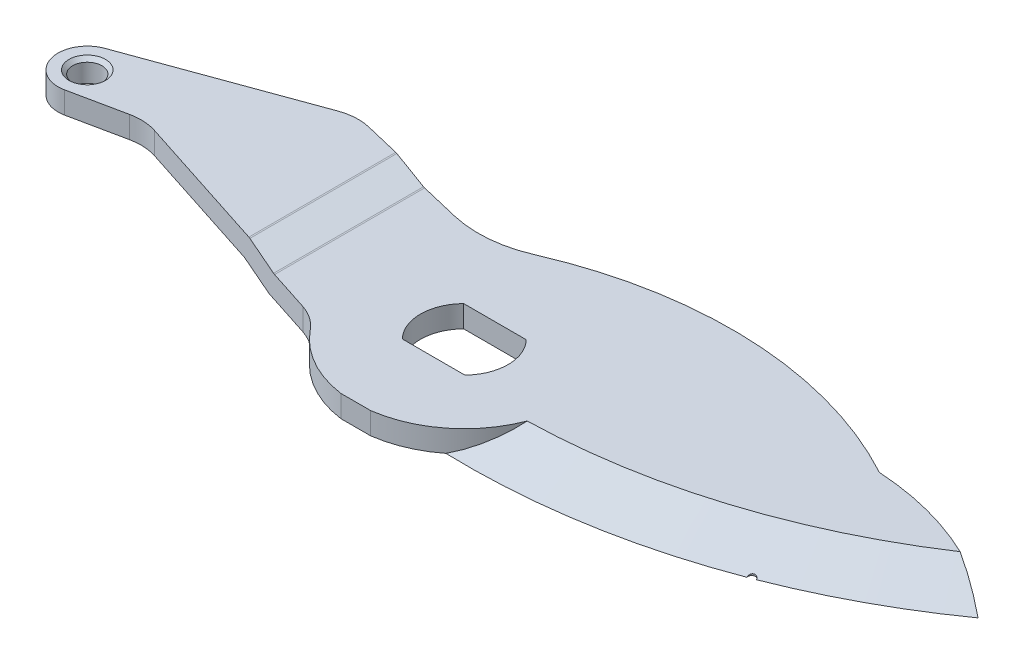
ISO-10303-21;
HEADER;
FILE_DESCRIPTION(('STEP AP214'),'2;1');
FILE_NAME('part.step','',(''),(''),'','','');
FILE_SCHEMA(('AUTOMOTIVE_DESIGN { 1 0 10303 214 1 1 1 1 }'));
ENDSEC;
DATA;
#1=APPLICATION_CONTEXT('core data for automotive mechanical design processes');
#2=APPLICATION_PROTOCOL_DEFINITION('international standard','automotive_design',2000,#1);
#3=PRODUCT_CONTEXT('',#1,'mechanical');
#4=PRODUCT('Part','Part','',(#3));
#5=PRODUCT_RELATED_PRODUCT_CATEGORY('part','',(#4));
#6=PRODUCT_DEFINITION_FORMATION('','',#4);
#7=PRODUCT_DEFINITION_CONTEXT('part definition',#1,'design');
#8=PRODUCT_DEFINITION('design','',#6,#7);
#9=PRODUCT_DEFINITION_SHAPE('','',#8);
#10=(LENGTH_UNIT() NAMED_UNIT(*) SI_UNIT(.MILLI.,.METRE.));
#11=(NAMED_UNIT(*) PLANE_ANGLE_UNIT() SI_UNIT($,.RADIAN.));
#12=(NAMED_UNIT(*) SI_UNIT($,.STERADIAN.) SOLID_ANGLE_UNIT());
#13=UNCERTAINTY_MEASURE_WITH_UNIT(LENGTH_MEASURE(1.E-05),#10,'distance_accuracy_value','');
#14=(GEOMETRIC_REPRESENTATION_CONTEXT(3) GLOBAL_UNCERTAINTY_ASSIGNED_CONTEXT((#13)) GLOBAL_UNIT_ASSIGNED_CONTEXT((#10,
#11,#12)) REPRESENTATION_CONTEXT('',''));
#15=CARTESIAN_POINT('',(0.,0.,0.));
#16=DIRECTION('',(0.,0.,1.));
#17=DIRECTION('',(1.,0.,0.));
#18=AXIS2_PLACEMENT_3D('',#15,#16,#17);
#19=CARTESIAN_POINT('',(34.,-3.,20.));
#20=DIRECTION('',(0.196116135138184,0.98058067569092,0.));
#21=DIRECTION('',(-0.98058067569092,0.196116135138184,0.));
#22=AXIS2_PLACEMENT_3D('',#19,#20,#21);
#23=PLANE('',#22);
#24=DIRECTION('',(-0.934672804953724,0.186934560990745,-0.302394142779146));
#25=VECTOR('',#24,1.);
#26=CARTESIAN_POINT('',(37.2586681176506,-3.65173362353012,9.52486321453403));
#27=LINE('',#26,#25);
#28=CARTESIAN_POINT('',(38.9029033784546,-3.98058067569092,10.0568216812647));
#29=VERTEX_POINT('',#28);
#30=CARTESIAN_POINT('',(34.0970966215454,-3.01941932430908,8.50200184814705));
#31=VERTEX_POINT('',#30);
#32=EDGE_CURVE('E260',#29,#31,#27,.T.);
#33=ORIENTED_EDGE('',*,*,#32,.T.);
#34=DIRECTION('',(0.,0.,-1.));
#35=VECTOR('',#34,1.);
#36=CARTESIAN_POINT('',(34.0970966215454,-3.01941932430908,-11.5656609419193));
#37=LINE('',#36,#35);
#38=CARTESIAN_POINT('',(34.0970966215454,-3.01941932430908,-11.5424396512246));
#39=VERTEX_POINT('',#38);
#40=EDGE_CURVE('E434',#31,#39,#37,.T.);
#41=ORIENTED_EDGE('',*,*,#40,.T.);
#42=DIRECTION('',(-0.954680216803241,0.190936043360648,-0.228318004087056));
#43=VECTOR('',#42,1.);
#44=CARTESIAN_POINT('',(40.8803886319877,-4.37607772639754,-9.92017109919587));
#45=LINE('',#44,#43);
#46=CARTESIAN_POINT('',(38.9029033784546,-3.98058067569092,-10.3930996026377));
#47=VERTEX_POINT('',#46);
#48=EDGE_CURVE('E426',#47,#39,#45,.T.);
#49=ORIENTED_EDGE('',*,*,#48,.F.);
#50=DIRECTION('',(0.,0.,-1.));
#51=VECTOR('',#50,1.);
#52=CARTESIAN_POINT('',(38.9029033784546,-3.98058067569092,10.0882352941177));
#53=LINE('',#52,#51);
#54=EDGE_CURVE('E439',#47,#29,#53,.F.);
#55=ORIENTED_EDGE('',*,*,#54,.T.);
#56=EDGE_LOOP('',(#33,#41,#49,#55));
#57=FACE_BOUND('',#56,.T.);
#58=ADVANCED_FACE('F35',(#57),#23,.F.);
#59=CARTESIAN_POINT('',(126.,-4.,20.));
#60=DIRECTION('',(0.,-1.,0.));
#61=DIRECTION('',(1.,0.,0.));
#62=AXIS2_PLACEMENT_3D('',#59,#60,#61);
#63=PLANE('',#62);
#64=CARTESIAN_POINT('',(105.839931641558,-4.,10.8252419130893));
#65=DIRECTION('',(0.,-1.,0.));
#66=DIRECTION('',(1.,0.,0.));
#67=AXIS2_PLACEMENT_3D('',#64,#65,#66);
#68=CIRCLE('',#67,0.499999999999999);
#69=CARTESIAN_POINT('',(105.372895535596,-4.,11.0037839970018));
#70=VERTEX_POINT('',#69);
#71=CARTESIAN_POINT('',(106.305988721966,-4.,10.6441596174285));
#72=VERTEX_POINT('',#71);
#73=EDGE_CURVE('E55',#70,#72,#68,.T.);
#74=ORIENTED_EDGE('',*,*,#73,.F.);
#75=CARTESIAN_POINT('',(72.8145799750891,-4.,-74.8634164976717));
#76=DIRECTION('',(0.,-1.,0.));
#77=DIRECTION('',(1.,0.,0.));
#78=AXIS2_PLACEMENT_3D('',#75,#76,#77);
#79=CIRCLE('',#78,91.8325652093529);
#80=CARTESIAN_POINT('',(70.0495756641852,-4.,16.9275132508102));
#81=VERTEX_POINT('',#80);
#82=EDGE_CURVE('E246',#70,#81,#79,.T.);
#83=ORIENTED_EDGE('',*,*,#82,.T.);
#84=CARTESIAN_POINT('',(60.7748747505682,-4.,5.13853861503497));
#85=DIRECTION('',(0.,-1.,0.));
#86=DIRECTION('',(1.,0.,0.));
#87=AXIS2_PLACEMENT_3D('',#84,#85,#86);
#88=CIRCLE('',#87,15.);
#89=CARTESIAN_POINT('',(62.8088279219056,-4.,20.));
#90=VERTEX_POINT('',#89);
#91=EDGE_CURVE('E500',#81,#90,#88,.T.);
#92=ORIENTED_EDGE('',*,*,#91,.T.);
#93=DIRECTION('',(-1.,0.,0.));
#94=VECTOR('',#93,1.);
#95=CARTESIAN_POINT('',(126.,-4.,20.));
#96=LINE('',#95,#94);
#97=CARTESIAN_POINT('',(58.7409215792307,-4.,20.));
#98=VERTEX_POINT('',#97);
#99=EDGE_CURVE('E268',#90,#98,#96,.T.);
#100=ORIENTED_EDGE('',*,*,#99,.T.);
#101=CARTESIAN_POINT('',(49.0992148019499,-4.,14.5554895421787));
#102=VERTEX_POINT('',#101);
#103=EDGE_CURVE('E496',#98,#102,#88,.T.);
#104=ORIENTED_EDGE('',*,*,#103,.T.);
#105=CARTESIAN_POINT('',(43.6505734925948,-4.,18.9500666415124));
#106=DIRECTION('',(0.,-1.,0.));
#107=DIRECTION('',(1.,0.,0.));
#108=AXIS2_PLACEMENT_3D('',#105,#106,#107);
#109=CIRCLE('',#108,7.);
#110=CARTESIAN_POINT('',(45.8053154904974,-4.,12.2899550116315));
#111=VERTEX_POINT('',#110);
#112=EDGE_CURVE('E351',#102,#111,#109,.F.);
#113=ORIENTED_EDGE('',*,*,#112,.T.);
#114=DIRECTION('',(0.951444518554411,0.,0.307820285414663));
#115=VECTOR('',#114,1.);
#116=CARTESIAN_POINT('',(120.659357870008,-4.,36.5074393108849));
#117=LINE('',#116,#115);
#118=CARTESIAN_POINT('',(39.0990195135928,-4.,10.1202710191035));
#119=VERTEX_POINT('',#118);
#120=EDGE_CURVE('E519',#119,#111,#117,.T.);
#121=ORIENTED_EDGE('',*,*,#120,.F.);
#122=DIRECTION('',(0.,0.,-1.));
#123=VECTOR('',#122,1.);
#124=CARTESIAN_POINT('',(39.0990195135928,-4.,-10.369878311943));
#125=LINE('',#124,#123);
#126=CARTESIAN_POINT('',(39.0990195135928,-4.,-10.3461971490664));
#127=VERTEX_POINT('',#126);
#128=EDGE_CURVE('E433',#119,#127,#125,.T.);
#129=ORIENTED_EDGE('',*,*,#128,.T.);
#130=DIRECTION('',(0.972573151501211,0.,0.232597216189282));
#131=VECTOR('',#130,1.);
#132=CARTESIAN_POINT('',(128.163379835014,-4.,10.954125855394));
#133=LINE('',#132,#131);
#134=CARTESIAN_POINT('',(45.4382120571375,-4.,-8.83013788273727));
#135=VERTEX_POINT('',#134);
#136=EDGE_CURVE('E507',#127,#135,#133,.T.);
#137=ORIENTED_EDGE('',*,*,#136,.T.);
#138=CARTESIAN_POINT('',(49.1597675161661,-4.,-24.3913083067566));
#139=DIRECTION('',(0.,-1.,0.));
#140=DIRECTION('',(1.,0.,0.));
#141=AXIS2_PLACEMENT_3D('',#138,#139,#140);
#142=CIRCLE('',#141,16.);
#143=CARTESIAN_POINT('',(55.5346345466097,-4.,-9.71612277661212));
#144=VERTEX_POINT('',#143);
#145=EDGE_CURVE('E342',#135,#144,#142,.F.);
#146=ORIENTED_EDGE('',*,*,#145,.T.);
#147=CARTESIAN_POINT('',(78.,-4.,42.));
#148=DIRECTION('',(0.,-1.,0.));
#149=DIRECTION('',(1.,0.,0.));
#150=AXIS2_PLACEMENT_3D('',#147,#148,#149);
#151=CIRCLE('',#150,56.3848383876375);
#152=CARTESIAN_POINT('',(105.,-4.,-7.5));
#153=VERTEX_POINT('',#152);
#154=EDGE_CURVE('E265',#153,#144,#151,.F.);
#155=ORIENTED_EDGE('',*,*,#154,.F.);
#156=CARTESIAN_POINT('',(102.664376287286,-4.,32.1897463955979));
#157=DIRECTION('',(0.,-1.,0.));
#158=DIRECTION('',(1.,0.,0.));
#159=AXIS2_PLACEMENT_3D('',#156,#157,#158);
#160=CIRCLE('',#159,39.758409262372);
#161=CARTESIAN_POINT('',(126.,-4.,0.));
#162=VERTEX_POINT('',#161);
#163=EDGE_CURVE('E259',#162,#153,#160,.F.);
#164=ORIENTED_EDGE('',*,*,#163,.F.);
#165=EDGE_CURVE('E249',#162,#72,#79,.T.);
#166=ORIENTED_EDGE('',*,*,#165,.T.);
#167=EDGE_LOOP('',(#74,#83,#92,#100,#104,#113,#121,#129,#137,#146,#155,#164,#166));
#168=FACE_BOUND('',#167,.T.);
#169=CARTESIAN_POINT('',(60.7748747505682,-4.,5.13853861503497));
#170=DIRECTION('',(0.,1.,0.));
#171=DIRECTION('',(0.,0.,1.));
#172=AXIS2_PLACEMENT_3D('',#169,#170,#171);
#173=CIRCLE('',#172,6.);
#174=CARTESIAN_POINT('',(65.0597318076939,-4.,9.33853861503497));
#175=VERTEX_POINT('',#174);
#176=CARTESIAN_POINT('',(65.0597318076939,-4.,0.93853861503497));
#177=VERTEX_POINT('',#176);
#178=EDGE_CURVE('E250',#175,#177,#173,.T.);
#179=ORIENTED_EDGE('',*,*,#178,.T.);
#180=DIRECTION('',(-1.,0.,0.));
#181=VECTOR('',#180,1.);
#182=CARTESIAN_POINT('',(65.0597318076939,-4.,0.93853861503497));
#183=LINE('',#182,#181);
#184=CARTESIAN_POINT('',(56.4900176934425,-4.,0.93853861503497));
#185=VERTEX_POINT('',#184);
#186=EDGE_CURVE('E874',#177,#185,#183,.T.);
#187=ORIENTED_EDGE('',*,*,#186,.T.);
#188=CARTESIAN_POINT('',(60.7748747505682,-4.,5.13853861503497));
#189=DIRECTION('',(0.,-1.,0.));
#190=DIRECTION('',(0.,0.,-1.));
#191=AXIS2_PLACEMENT_3D('',#188,#189,#190);
#192=CIRCLE('',#191,6.);
#193=CARTESIAN_POINT('',(56.4900176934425,-4.,9.33853861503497));
#194=VERTEX_POINT('',#193);
#195=EDGE_CURVE('E867',#194,#185,#192,.T.);
#196=ORIENTED_EDGE('',*,*,#195,.F.);
#197=DIRECTION('',(-1.,0.,0.));
#198=VECTOR('',#197,1.);
#199=CARTESIAN_POINT('',(65.0597318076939,-4.,9.33853861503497));
#200=LINE('',#199,#198);
#201=EDGE_CURVE('E870',#175,#194,#200,.T.);
#202=ORIENTED_EDGE('',*,*,#201,.F.);
#203=EDGE_LOOP('',(#179,#187,#196,#202));
#204=FACE_BOUND('',#203,.T.);
#205=ADVANCED_FACE('F243',(#168,#204),#63,.T.);
#206=CARTESIAN_POINT('',(40.,-1.,20.));
#207=DIRECTION('',(0.,1.,0.));
#208=DIRECTION('',(0.,0.,1.));
#209=AXIS2_PLACEMENT_3D('',#206,#207,#208);
#210=PLANE('',#209);
#211=CARTESIAN_POINT('',(60.7748747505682,-1.,5.13853861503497));
#212=DIRECTION('',(0.,1.,0.));
#213=DIRECTION('',(0.,0.,1.));
#214=AXIS2_PLACEMENT_3D('',#211,#212,#213);
#215=CIRCLE('',#214,6.);
#216=CARTESIAN_POINT('',(65.0597318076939,-1.,9.33853861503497));
#217=VERTEX_POINT('',#216);
#218=CARTESIAN_POINT('',(65.0597318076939,-1.,0.93853861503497));
#219=VERTEX_POINT('',#218);
#220=EDGE_CURVE('E310',#217,#219,#215,.T.);
#221=ORIENTED_EDGE('',*,*,#220,.F.);
#222=DIRECTION('',(-1.,0.,0.));
#223=VECTOR('',#222,1.);
#224=CARTESIAN_POINT('',(40.,-1.,9.33853861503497));
#225=LINE('',#224,#223);
#226=CARTESIAN_POINT('',(56.4900176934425,-1.,9.33853861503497));
#227=VERTEX_POINT('',#226);
#228=EDGE_CURVE('E307',#217,#227,#225,.T.);
#229=ORIENTED_EDGE('',*,*,#228,.T.);
#230=CARTESIAN_POINT('',(60.7748747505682,-1.,5.13853861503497));
#231=DIRECTION('',(0.,1.,0.));
#232=DIRECTION('',(0.,0.,1.));
#233=AXIS2_PLACEMENT_3D('',#230,#231,#232);
#234=CIRCLE('',#233,6.);
#235=CARTESIAN_POINT('',(56.4900176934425,-1.,0.93853861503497));
#236=VERTEX_POINT('',#235);
#237=EDGE_CURVE('E304',#227,#236,#234,.F.);
#238=ORIENTED_EDGE('',*,*,#237,.T.);
#239=DIRECTION('',(-1.,0.,0.));
#240=VECTOR('',#239,1.);
#241=CARTESIAN_POINT('',(40.,-1.,0.93853861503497));
#242=LINE('',#241,#240);
#243=EDGE_CURVE('E289',#219,#236,#242,.T.);
#244=ORIENTED_EDGE('',*,*,#243,.F.);
#245=EDGE_LOOP('',(#221,#229,#238,#244));
#246=FACE_BOUND('',#245,.T.);
#247=DIRECTION('',(-0.972573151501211,0.,-0.232597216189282));
#248=VECTOR('',#247,1.);
#249=CARTESIAN_POINT('',(46.8161058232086,-1.,-8.5006055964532));
#250=LINE('',#249,#248);
#251=CARTESIAN_POINT('',(45.4382120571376,-1.,-8.83013788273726));
#252=VERTEX_POINT('',#251);
#253=CARTESIAN_POINT('',(40.0990195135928,-1.,-10.1070406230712));
#254=VERTEX_POINT('',#253);
#255=EDGE_CURVE('E504',#252,#254,#250,.T.);
#256=ORIENTED_EDGE('',*,*,#255,.T.);
#257=DIRECTION('',(0.,0.,-1.));
#258=VECTOR('',#257,1.);
#259=CARTESIAN_POINT('',(40.0990195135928,-1.,10.4117647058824));
#260=LINE('',#259,#258);
#261=CARTESIAN_POINT('',(40.0990195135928,-1.,10.4438004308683));
#262=VERTEX_POINT('',#261);
#263=EDGE_CURVE('E531',#254,#262,#260,.F.);
#264=ORIENTED_EDGE('',*,*,#263,.T.);
#265=DIRECTION('',(-0.951444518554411,0.,-0.307820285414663));
#266=VECTOR('',#265,1.);
#267=CARTESIAN_POINT('',(42.8081440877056,-1.,11.3202819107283));
#268=LINE('',#267,#266);
#269=CARTESIAN_POINT('',(45.8053154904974,-1.,12.2899550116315));
#270=VERTEX_POINT('',#269);
#271=EDGE_CURVE('E516',#270,#262,#268,.T.);
#272=ORIENTED_EDGE('',*,*,#271,.F.);
#273=CARTESIAN_POINT('',(43.6505734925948,-1.,18.9500666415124));
#274=DIRECTION('',(0.,1.,0.));
#275=DIRECTION('',(0.,0.,1.));
#276=AXIS2_PLACEMENT_3D('',#273,#274,#275);
#277=CIRCLE('',#276,7.);
#278=CARTESIAN_POINT('',(49.0992148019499,-1.,14.5554895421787));
#279=VERTEX_POINT('',#278);
#280=EDGE_CURVE('E349',#270,#279,#277,.F.);
#281=ORIENTED_EDGE('',*,*,#280,.T.);
#282=CARTESIAN_POINT('',(60.7748747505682,-1.,5.13853861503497));
#283=DIRECTION('',(0.,1.,0.));
#284=DIRECTION('',(0.,0.,1.));
#285=AXIS2_PLACEMENT_3D('',#282,#283,#284);
#286=CIRCLE('',#285,15.);
#287=CARTESIAN_POINT('',(58.7409215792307,-1.,20.));
#288=VERTEX_POINT('',#287);
#289=EDGE_CURVE('E489',#279,#288,#286,.T.);
#290=ORIENTED_EDGE('',*,*,#289,.T.);
#291=DIRECTION('',(1.,0.,0.));
#292=VECTOR('',#291,1.);
#293=CARTESIAN_POINT('',(40.,-1.,20.));
#294=LINE('',#293,#292);
#295=CARTESIAN_POINT('',(62.8088279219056,-1.,20.));
#296=VERTEX_POINT('',#295);
#297=EDGE_CURVE('E271',#288,#296,#294,.T.);
#298=ORIENTED_EDGE('',*,*,#297,.T.);
#299=CARTESIAN_POINT('',(74.7789749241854,-1.,10.513031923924));
#300=VERTEX_POINT('',#299);
#301=EDGE_CURVE('E497',#296,#300,#286,.T.);
#302=ORIENTED_EDGE('',*,*,#301,.T.);
#303=CARTESIAN_POINT('',(72.8145799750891,-1.,-74.8634164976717));
#304=DIRECTION('',(0.,1.,0.));
#305=DIRECTION('',(0.,0.,1.));
#306=AXIS2_PLACEMENT_3D('',#303,#304,#305);
#307=CIRCLE('',#306,85.399044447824);
#308=CARTESIAN_POINT('',(119.91826897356,-1.,-3.62972169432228));
#309=VERTEX_POINT('',#308);
#310=EDGE_CURVE('E354',#300,#309,#307,.T.);
#311=ORIENTED_EDGE('',*,*,#310,.T.);
#312=CARTESIAN_POINT('',(102.664376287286,-1.,32.1897463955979));
#313=DIRECTION('',(0.,1.,0.));
#314=DIRECTION('',(0.,0.,1.));
#315=AXIS2_PLACEMENT_3D('',#312,#313,#314);
#316=CIRCLE('',#315,39.758409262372);
#317=CARTESIAN_POINT('',(105.,-1.,-7.5));
#318=VERTEX_POINT('',#317);
#319=EDGE_CURVE('E284',#318,#309,#316,.F.);
#320=ORIENTED_EDGE('',*,*,#319,.F.);
#321=CARTESIAN_POINT('',(78.,-1.,42.));
#322=DIRECTION('',(0.,1.,0.));
#323=DIRECTION('',(0.,0.,1.));
#324=AXIS2_PLACEMENT_3D('',#321,#322,#323);
#325=CIRCLE('',#324,56.3848383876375);
#326=CARTESIAN_POINT('',(55.5346345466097,-1.,-9.71612277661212));
#327=VERTEX_POINT('',#326);
#328=EDGE_CURVE('E287',#327,#318,#325,.F.);
#329=ORIENTED_EDGE('',*,*,#328,.F.);
#330=CARTESIAN_POINT('',(49.1597675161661,-1.,-24.3913083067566));
#331=DIRECTION('',(0.,1.,0.));
#332=DIRECTION('',(0.,0.,1.));
#333=AXIS2_PLACEMENT_3D('',#330,#331,#332);
#334=CIRCLE('',#333,16.);
#335=EDGE_CURVE('E340',#327,#252,#334,.F.);
#336=ORIENTED_EDGE('',*,*,#335,.T.);
#337=EDGE_LOOP('',(#256,#264,#272,#281,#290,#298,#302,#311,#320,#329,#336));
#338=FACE_BOUND('',#337,.T.);
#339=ADVANCED_FACE('F398',(#246,#338),#210,.T.);
#340=CARTESIAN_POINT('',(35.,0.,20.));
#341=DIRECTION('',(0.196116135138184,0.98058067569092,0.));
#342=DIRECTION('',(-0.98058067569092,0.196116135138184,0.));
#343=AXIS2_PLACEMENT_3D('',#340,#341,#342);
#344=PLANE('',#343);
#345=DIRECTION('',(-0.954680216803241,0.190936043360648,-0.228318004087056));
#346=VECTOR('',#345,1.);
#347=CARTESIAN_POINT('',(41.8282595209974,-1.36565190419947,-9.69348159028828));
#348=LINE('',#347,#346);
#349=CARTESIAN_POINT('',(39.9029033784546,-0.980580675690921,-10.1539430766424));
#350=VERTEX_POINT('',#349);
#351=CARTESIAN_POINT('',(35.0970966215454,-0.0194193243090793,-11.3032831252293));
#352=VERTEX_POINT('',#351);
#353=EDGE_CURVE('E501',#350,#352,#348,.T.);
#354=ORIENTED_EDGE('',*,*,#353,.T.);
#355=DIRECTION('',(0.,0.,-1.));
#356=VECTOR('',#355,1.);
#357=CARTESIAN_POINT('',(35.0970966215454,-0.0194193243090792,20.));
#358=LINE('',#357,#356);
#359=CARTESIAN_POINT('',(35.0970966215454,-0.0194193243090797,8.82553125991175));
#360=VERTEX_POINT('',#359);
#361=EDGE_CURVE('E529',#352,#360,#358,.F.);
#362=ORIENTED_EDGE('',*,*,#361,.T.);
#363=DIRECTION('',(-0.934672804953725,0.186934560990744,-0.302394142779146));
#364=VECTOR('',#363,1.);
#365=CARTESIAN_POINT('',(38.1672259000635,-0.633445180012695,9.8188083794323));
#366=LINE('',#365,#364);
#367=CARTESIAN_POINT('',(39.9029033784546,-0.980580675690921,10.3803510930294));
#368=VERTEX_POINT('',#367);
#369=EDGE_CURVE('E513',#368,#360,#366,.T.);
#370=ORIENTED_EDGE('',*,*,#369,.F.);
#371=DIRECTION('',(0.,0.,-1.));
#372=VECTOR('',#371,1.);
#373=CARTESIAN_POINT('',(39.9029033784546,-0.980580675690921,-10.1307217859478));
#374=LINE('',#373,#372);
#375=EDGE_CURVE('E533',#368,#350,#374,.T.);
#376=ORIENTED_EDGE('',*,*,#375,.T.);
#377=EDGE_LOOP('',(#354,#362,#370,#376));
#378=FACE_BOUND('',#377,.T.);
#379=ADVANCED_FACE('F390',(#378),#344,.T.);
#380=CARTESIAN_POINT('',(0.,-3.,20.));
#381=DIRECTION('',(0.,0.,1.));
#382=DIRECTION('',(1.,0.,0.));
#383=AXIS2_PLACEMENT_3D('',#380,#381,#382);
#384=PLANE('',#383);
#385=ORIENTED_EDGE('',*,*,#99,.F.);
#386=DIRECTION('',(0.,1.,0.));
#387=VECTOR('',#386,1.);
#388=CARTESIAN_POINT('',(62.8088279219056,-5.99999999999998,20.));
#389=LINE('',#388,#387);
#390=EDGE_CURVE('E281',#90,#296,#389,.T.);
#391=ORIENTED_EDGE('',*,*,#390,.T.);
#392=ORIENTED_EDGE('',*,*,#297,.F.);
#393=DIRECTION('',(0.,1.,0.));
#394=VECTOR('',#393,1.);
#395=CARTESIAN_POINT('',(58.7409215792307,-5.99999999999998,20.));
#396=LINE('',#395,#394);
#397=EDGE_CURVE('E278',#288,#98,#396,.F.);
#398=ORIENTED_EDGE('',*,*,#397,.T.);
#399=EDGE_LOOP('',(#385,#391,#392,#398));
#400=FACE_BOUND('',#399,.T.);
#401=ADVANCED_FACE('F387',(#400),#384,.T.);
#402=CARTESIAN_POINT('',(0.,0.,20.));
#403=DIRECTION('',(1.,0.,0.));
#404=DIRECTION('',(0.,1.,0.));
#405=AXIS2_PLACEMENT_3D('',#402,#403,#404);
#406=PLANE('',#405);
#407=DIRECTION('',(0.,0.,-1.));
#408=VECTOR('',#407,1.);
#409=CARTESIAN_POINT('',(0.,0.,20.));
#410=LINE('',#409,#408);
#411=CARTESIAN_POINT('',(0.,0.,0.0094355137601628));
#412=VERTEX_POINT('',#411);
#413=CARTESIAN_POINT('',(0.,0.,-0.0100405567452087));
#414=VERTEX_POINT('',#413);
#415=EDGE_CURVE('E274',#412,#414,#410,.T.);
#416=ORIENTED_EDGE('',*,*,#415,.T.);
#417=DIRECTION('',(0.,1.,0.));
#418=VECTOR('',#417,1.);
#419=CARTESIAN_POINT('',(1.11022302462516E-13,-6.00000000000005,-0.0100405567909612));
#420=LINE('',#419,#418);
#421=CARTESIAN_POINT('',(0.,-3.,-0.0100405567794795));
#422=VERTEX_POINT('',#421);
#423=EDGE_CURVE('E295',#414,#422,#420,.F.);
#424=ORIENTED_EDGE('',*,*,#423,.T.);
#425=DIRECTION('',(0.,0.,1.));
#426=VECTOR('',#425,1.);
#427=CARTESIAN_POINT('',(0.,-3.,20.));
#428=LINE('',#427,#426);
#429=CARTESIAN_POINT('',(0.,-3.,0.00943551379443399));
#430=VERTEX_POINT('',#429);
#431=EDGE_CURVE('E277',#430,#422,#428,.F.);
#432=ORIENTED_EDGE('',*,*,#431,.F.);
#433=DIRECTION('',(0.,1.,0.));
#434=VECTOR('',#433,1.);
#435=CARTESIAN_POINT('',(1.11022302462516E-13,-6.00000000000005,0.00943551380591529));
#436=LINE('',#435,#434);
#437=EDGE_CURVE('E290',#430,#412,#436,.T.);
#438=ORIENTED_EDGE('',*,*,#437,.T.);
#439=EDGE_LOOP('',(#416,#424,#432,#438));
#440=FACE_BOUND('',#439,.T.);
#441=ADVANCED_FACE('F37',(#440),#406,.F.);
#442=CARTESIAN_POINT('',(0.,-3.,20.));
#443=DIRECTION('',(0.,1.,0.));
#444=DIRECTION('',(0.,0.,1.));
#445=AXIS2_PLACEMENT_3D('',#442,#443,#444);
#446=PLANE('',#445);
#447=CARTESIAN_POINT('',(3.99998814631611,-3.,-0.000302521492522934));
#448=DIRECTION('',(0.,1.,0.));
#449=DIRECTION('',(0.,0.,1.));
#450=AXIS2_PLACEMENT_3D('',#447,#448,#449);
#451=CIRCLE('',#450,2.00030252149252);
#452=CARTESIAN_POINT('',(3.99998814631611,-3.,2.));
#453=VERTEX_POINT('',#452);
#454=EDGE_CURVE('E416',#453,#453,#451,.T.);
#455=ORIENTED_EDGE('',*,*,#454,.T.);
#456=EDGE_LOOP('',(#455));
#457=FACE_BOUND('',#456,.T.);
#458=DIRECTION('',(-0.972573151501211,0.,-0.232597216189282));
#459=VECTOR('',#458,1.);
#460=CARTESIAN_POINT('',(8.98016442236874,-3.,-17.5493178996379));
#461=LINE('',#460,#459);
#462=CARTESIAN_POINT('',(33.9009804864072,-3.,-11.5893421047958));
#463=VERTEX_POINT('',#462);
#464=CARTESIAN_POINT('',(30.0466919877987,-3.,-12.5111203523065));
#465=VERTEX_POINT('',#464);
#466=EDGE_CURVE('E418',#463,#465,#461,.T.);
#467=ORIENTED_EDGE('',*,*,#466,.F.);
#468=DIRECTION('',(0.,0.,-1.));
#469=VECTOR('',#468,1.);
#470=CARTESIAN_POINT('',(33.9009804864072,-3.,8.47058823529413));
#471=LINE('',#470,#469);
#472=CARTESIAN_POINT('',(33.9009804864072,-3.,8.43855251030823));
#473=VERTEX_POINT('',#472);
#474=EDGE_CURVE('E420',#463,#473,#471,.F.);
#475=ORIENTED_EDGE('',*,*,#474,.T.);
#476=DIRECTION('',(-0.951444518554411,0.,-0.307820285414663));
#477=VECTOR('',#476,1.);
#478=CARTESIAN_POINT('',(6.59827721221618,-3.,-0.394675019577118));
#479=LINE('',#478,#477);
#480=CARTESIAN_POINT('',(15.7664958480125,-3.,2.57151336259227));
#481=VERTEX_POINT('',#480);
#482=EDGE_CURVE('E257',#473,#481,#479,.T.);
#483=ORIENTED_EDGE('',*,*,#482,.T.);
#484=CARTESIAN_POINT('',(13.6117538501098,-3.,9.23162499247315));
#485=DIRECTION('',(0.,1.,0.));
#486=DIRECTION('',(0.,0.,1.));
#487=AXIS2_PLACEMENT_3D('',#484,#485,#486);
#488=CIRCLE('',#487,7.);
#489=CARTESIAN_POINT('',(12.1824684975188,-3.,2.37909674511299));
#490=VERTEX_POINT('',#489);
#491=EDGE_CURVE('E332',#481,#490,#488,.T.);
#492=ORIENTED_EDGE('',*,*,#491,.T.);
#493=DIRECTION('',(-0.978932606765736,0.,0.204183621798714));
#494=VECTOR('',#493,1.);
#495=CARTESIAN_POINT('',(-3.0142027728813,-3.,5.54878519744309));
#496=LINE('',#495,#494);
#497=CARTESIAN_POINT('',(4.81672263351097,-3.,3.91542790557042));
#498=VERTEX_POINT('',#497);
#499=EDGE_CURVE('E293',#490,#498,#496,.T.);
#500=ORIENTED_EDGE('',*,*,#499,.T.);
#501=CARTESIAN_POINT('',(3.99998814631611,-3.,-0.000302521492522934));
#502=DIRECTION('',(0.,1.,0.));
#503=DIRECTION('',(0.,0.,1.));
#504=AXIS2_PLACEMENT_3D('',#501,#502,#503);
#505=CIRCLE('',#504,4.);
#506=EDGE_CURVE('E294',#498,#430,#505,.F.);
#507=ORIENTED_EDGE('',*,*,#506,.T.);
#508=ORIENTED_EDGE('',*,*,#431,.T.);
#509=CARTESIAN_POINT('',(2.63081187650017,-3.,-3.75867402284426));
#510=VERTEX_POINT('',#509);
#511=EDGE_CURVE('E298',#422,#510,#505,.F.);
#512=ORIENTED_EDGE('',*,*,#511,.T.);
#513=DIRECTION('',(-0.939592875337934,0.,0.342294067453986));
#514=VECTOR('',#513,1.);
#515=CARTESIAN_POINT('',(-7.33295538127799,-3.,-0.12886954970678));
#516=LINE('',#515,#514);
#517=CARTESIAN_POINT('',(26.0224530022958,-3.,-12.2802584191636));
#518=VERTEX_POINT('',#517);
#519=EDGE_CURVE('E425',#518,#510,#516,.T.);
#520=ORIENTED_EDGE('',*,*,#519,.F.);
#521=CARTESIAN_POINT('',(28.4185114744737,-3.,-5.70310829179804));
#522=DIRECTION('',(0.,1.,0.));
#523=DIRECTION('',(0.,0.,1.));
#524=AXIS2_PLACEMENT_3D('',#521,#522,#523);
#525=CIRCLE('',#524,7.);
#526=EDGE_CURVE('E320',#518,#465,#525,.F.);
#527=ORIENTED_EDGE('',*,*,#526,.T.);
#528=EDGE_LOOP('',(#467,#475,#483,#492,#500,#507,#508,#512,#520,#527));
#529=FACE_BOUND('',#528,.T.);
#530=ADVANCED_FACE('F394',(#457,#529),#446,.F.);
#531=CARTESIAN_POINT('',(0.,0.,20.));
#532=DIRECTION('',(0.,1.,0.));
#533=DIRECTION('',(0.,0.,1.));
#534=AXIS2_PLACEMENT_3D('',#531,#532,#533);
#535=PLANE('',#534);
#536=CARTESIAN_POINT('',(3.99998814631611,0.,-0.000302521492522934));
#537=DIRECTION('',(0.,1.,0.));
#538=DIRECTION('',(0.,0.,1.));
#539=AXIS2_PLACEMENT_3D('',#536,#537,#538);
#540=CIRCLE('',#539,2.50030252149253);
#541=CARTESIAN_POINT('',(3.99998814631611,0.,2.5));
#542=VERTEX_POINT('',#541);
#543=EDGE_CURVE('E48',#542,#542,#540,.F.);
#544=ORIENTED_EDGE('',*,*,#543,.T.);
#545=EDGE_LOOP('',(#544));
#546=FACE_BOUND('',#545,.T.);
#547=DIRECTION('',(-0.951444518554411,0.,-0.307820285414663));
#548=VECTOR('',#547,1.);
#549=CARTESIAN_POINT('',(48.,0.,13.));
#550=LINE('',#549,#548);
#551=CARTESIAN_POINT('',(34.9009804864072,0.,8.76208192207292));
#552=VERTEX_POINT('',#551);
#553=CARTESIAN_POINT('',(15.7664958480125,0.,2.57151336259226));
#554=VERTEX_POINT('',#553);
#555=EDGE_CURVE('E483',#552,#554,#550,.T.);
#556=ORIENTED_EDGE('',*,*,#555,.F.);
#557=DIRECTION('',(0.,0.,-1.));
#558=VECTOR('',#557,1.);
#559=CARTESIAN_POINT('',(34.9009804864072,0.,20.));
#560=LINE('',#559,#558);
#561=CARTESIAN_POINT('',(34.9009804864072,0.,-11.3501855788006));
#562=VERTEX_POINT('',#561);
#563=EDGE_CURVE('E553',#552,#562,#560,.T.);
#564=ORIENTED_EDGE('',*,*,#563,.T.);
#565=DIRECTION('',(-0.97257315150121,0.,-0.232597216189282));
#566=VECTOR('',#565,1.);
#567=CARTESIAN_POINT('',(51.,0.,-7.5));
#568=LINE('',#567,#566);
#569=CARTESIAN_POINT('',(30.0466919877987,0.,-12.5111203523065));
#570=VERTEX_POINT('',#569);
#571=EDGE_CURVE('E465',#562,#570,#568,.T.);
#572=ORIENTED_EDGE('',*,*,#571,.T.);
#573=CARTESIAN_POINT('',(28.4185114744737,0.,-5.70310829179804));
#574=DIRECTION('',(0.,1.,0.));
#575=DIRECTION('',(0.,0.,1.));
#576=AXIS2_PLACEMENT_3D('',#573,#574,#575);
#577=CIRCLE('',#576,7.);
#578=CARTESIAN_POINT('',(26.0224530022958,0.,-12.2802584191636));
#579=VERTEX_POINT('',#578);
#580=EDGE_CURVE('E316',#570,#579,#577,.T.);
#581=ORIENTED_EDGE('',*,*,#580,.T.);
#582=DIRECTION('',(-0.939592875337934,0.,0.342294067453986));
#583=VECTOR('',#582,1.);
#584=CARTESIAN_POINT('',(27.9998682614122,0.,-13.0006316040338));
#585=LINE('',#584,#583);
#586=CARTESIAN_POINT('',(2.63081187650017,0.,-3.75867402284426));
#587=VERTEX_POINT('',#586);
#588=EDGE_CURVE('E468',#579,#587,#585,.T.);
#589=ORIENTED_EDGE('',*,*,#588,.T.);
#590=CARTESIAN_POINT('',(3.99998814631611,0.,-0.000302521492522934));
#591=DIRECTION('',(0.,-1.,0.));
#592=DIRECTION('',(0.,0.,-1.));
#593=AXIS2_PLACEMENT_3D('',#590,#591,#592);
#594=CIRCLE('',#593,4.);
#595=EDGE_CURVE('E478',#414,#587,#594,.T.);
#596=ORIENTED_EDGE('',*,*,#595,.F.);
#597=ORIENTED_EDGE('',*,*,#415,.F.);
#598=CARTESIAN_POINT('',(4.81672263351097,0.,3.91542790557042));
#599=VERTEX_POINT('',#598);
#600=EDGE_CURVE('E479',#599,#412,#594,.T.);
#601=ORIENTED_EDGE('',*,*,#600,.F.);
#602=DIRECTION('',(-0.978932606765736,0.,0.204183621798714));
#603=VECTOR('',#602,1.);
#604=CARTESIAN_POINT('',(14.,0.,2.));
#605=LINE('',#604,#603);
#606=CARTESIAN_POINT('',(12.1824684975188,0.,2.37909674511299));
#607=VERTEX_POINT('',#606);
#608=EDGE_CURVE('E481',#607,#599,#605,.T.);
#609=ORIENTED_EDGE('',*,*,#608,.F.);
#610=CARTESIAN_POINT('',(13.6117538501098,0.,9.23162499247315));
#611=DIRECTION('',(0.,1.,0.));
#612=DIRECTION('',(0.,0.,1.));
#613=AXIS2_PLACEMENT_3D('',#610,#611,#612);
#614=CIRCLE('',#613,7.);
#615=EDGE_CURVE('E329',#607,#554,#614,.F.);
#616=ORIENTED_EDGE('',*,*,#615,.T.);
#617=EDGE_LOOP('',(#556,#564,#572,#581,#589,#596,#597,#601,#609,#616));
#618=FACE_BOUND('',#617,.T.);
#619=ADVANCED_FACE('F384',(#546,#618),#535,.T.);
#620=CARTESIAN_POINT('',(60.7748747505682,-5.99999999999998,5.13853861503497));
#621=DIRECTION('',(0.,1.,0.));
#622=DIRECTION('',(0.,0.,1.));
#623=AXIS2_PLACEMENT_3D('',#620,#621,#622);
#624=CYLINDRICAL_SURFACE('',#623,15.);
#625=ORIENTED_EDGE('',*,*,#289,.F.);
#626=DIRECTION('',(0.,1.,0.));
#627=VECTOR('',#626,1.);
#628=CARTESIAN_POINT('',(49.0992148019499,-5.99999999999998,14.5554895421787));
#629=LINE('',#628,#627);
#630=EDGE_CURVE('E347',#279,#102,#629,.F.);
#631=ORIENTED_EDGE('',*,*,#630,.T.);
#632=ORIENTED_EDGE('',*,*,#103,.F.);
#633=ORIENTED_EDGE('',*,*,#397,.F.);
#634=EDGE_LOOP('',(#625,#631,#632,#633));
#635=FACE_BOUND('',#634,.T.);
#636=ADVANCED_FACE('F379',(#635),#624,.T.);
#637=CARTESIAN_POINT('',(3.99998814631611,-5.99999999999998,-0.000302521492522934));
#638=DIRECTION('',(0.,1.,0.));
#639=DIRECTION('',(0.,0.,1.));
#640=AXIS2_PLACEMENT_3D('',#637,#638,#639);
#641=CYLINDRICAL_SURFACE('',#640,4.);
#642=ORIENTED_EDGE('',*,*,#506,.F.);
#643=DIRECTION('',(0.,1.,0.));
#644=VECTOR('',#643,1.);
#645=CARTESIAN_POINT('',(4.81672263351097,-5.99999999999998,3.91542790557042));
#646=LINE('',#645,#644);
#647=EDGE_CURVE('E486',#498,#599,#646,.T.);
#648=ORIENTED_EDGE('',*,*,#647,.T.);
#649=ORIENTED_EDGE('',*,*,#600,.T.);
#650=ORIENTED_EDGE('',*,*,#437,.F.);
#651=EDGE_LOOP('',(#642,#648,#649,#650));
#652=FACE_BOUND('',#651,.T.);
#653=ADVANCED_FACE('F383',(#652),#641,.T.);
#654=CARTESIAN_POINT('',(14.,-5.99999999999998,2.));
#655=DIRECTION('',(-0.204183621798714,0.,-0.978932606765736));
#656=DIRECTION('',(-0.978932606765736,0.,0.204183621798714));
#657=AXIS2_PLACEMENT_3D('',#654,#655,#656);
#658=PLANE('',#657);
#659=ORIENTED_EDGE('',*,*,#499,.F.);
#660=DIRECTION('',(0.,1.,0.));
#661=VECTOR('',#660,1.);
#662=CARTESIAN_POINT('',(12.1824684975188,0.,2.37909674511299));
#663=LINE('',#662,#661);
#664=EDGE_CURVE('E323',#490,#607,#663,.T.);
#665=ORIENTED_EDGE('',*,*,#664,.T.);
#666=ORIENTED_EDGE('',*,*,#608,.T.);
#667=ORIENTED_EDGE('',*,*,#647,.F.);
#668=EDGE_LOOP('',(#659,#665,#666,#667));
#669=FACE_BOUND('',#668,.T.);
#670=ADVANCED_FACE('F586',(#669),#658,.F.);
#671=CARTESIAN_POINT('',(48.,-5.99999999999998,13.));
#672=DIRECTION('',(0.307820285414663,0.,-0.951444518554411));
#673=DIRECTION('',(-0.951444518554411,0.,-0.307820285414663));
#674=AXIS2_PLACEMENT_3D('',#671,#672,#673);
#675=PLANE('',#674);
#676=ORIENTED_EDGE('',*,*,#369,.T.);
#677=CARTESIAN_POINT('',(34.9009804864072,-1.,8.76208192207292));
#678=DIRECTION('',(0.307820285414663,0.,-0.951444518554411));
#679=DIRECTION('',(-0.951444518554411,0.,-0.307820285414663));
#680=AXIS2_PLACEMENT_3D('',#677,#678,#679);
#681=ELLIPSE('',#680,1.05103343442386,1.);
#682=EDGE_CURVE('E528',#360,#552,#681,.F.);
#683=ORIENTED_EDGE('',*,*,#682,.T.);
#684=ORIENTED_EDGE('',*,*,#555,.T.);
#685=DIRECTION('',(0.,1.,0.));
#686=VECTOR('',#685,1.);
#687=CARTESIAN_POINT('',(15.7664958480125,-3.,2.57151336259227));
#688=LINE('',#687,#686);
#689=EDGE_CURVE('E326',#554,#481,#688,.F.);
#690=ORIENTED_EDGE('',*,*,#689,.T.);
#691=ORIENTED_EDGE('',*,*,#482,.F.);
#692=CARTESIAN_POINT('',(33.9009804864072,-4.,8.43855251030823));
#693=DIRECTION('',(0.307820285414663,0.,-0.951444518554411));
#694=DIRECTION('',(0.951444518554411,0.,0.307820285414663));
#695=AXIS2_PLACEMENT_3D('',#692,#693,#694);
#696=ELLIPSE('',#695,1.05103343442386,1.);
#697=EDGE_CURVE('E63',#473,#31,#696,.T.);
#698=ORIENTED_EDGE('',*,*,#697,.T.);
#699=ORIENTED_EDGE('',*,*,#32,.F.);
#700=CARTESIAN_POINT('',(39.0990195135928,-3.,10.1202710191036));
#701=DIRECTION('',(0.307820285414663,0.,-0.951444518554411));
#702=DIRECTION('',(0.951444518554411,0.,0.307820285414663));
#703=AXIS2_PLACEMENT_3D('',#700,#701,#702);
#704=ELLIPSE('',#703,1.05103343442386,1.);
#705=EDGE_CURVE('E524',#29,#119,#704,.F.);
#706=ORIENTED_EDGE('',*,*,#705,.T.);
#707=ORIENTED_EDGE('',*,*,#120,.T.);
#708=DIRECTION('',(0.,1.,0.));
#709=VECTOR('',#708,1.);
#710=CARTESIAN_POINT('',(45.8053154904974,-5.99999999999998,12.2899550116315));
#711=LINE('',#710,#709);
#712=EDGE_CURVE('E344',#111,#270,#711,.T.);
#713=ORIENTED_EDGE('',*,*,#712,.T.);
#714=ORIENTED_EDGE('',*,*,#271,.T.);
#715=CARTESIAN_POINT('',(40.0990195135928,0.,10.4438004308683));
#716=DIRECTION('',(0.307820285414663,0.,-0.951444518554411));
#717=DIRECTION('',(0.951444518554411,0.,0.307820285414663));
#718=AXIS2_PLACEMENT_3D('',#715,#716,#717);
#719=ELLIPSE('',#718,1.05103343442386,1.);
#720=EDGE_CURVE('E444',#262,#368,#719,.T.);
#721=ORIENTED_EDGE('',*,*,#720,.T.);
#722=EDGE_LOOP('',(#676,#683,#684,#690,#691,#698,#699,#706,#707,#713,#714,#721));
#723=FACE_BOUND('',#722,.T.);
#724=ADVANCED_FACE('F523',(#723),#675,.F.);
#725=ORIENTED_EDGE('',*,*,#595,.T.);
#726=DIRECTION('',(0.,1.,0.));
#727=VECTOR('',#726,1.);
#728=CARTESIAN_POINT('',(2.63081187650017,-5.99999999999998,-3.75867402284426));
#729=LINE('',#728,#727);
#730=EDGE_CURVE('E490',#510,#587,#729,.T.);
#731=ORIENTED_EDGE('',*,*,#730,.F.);
#732=ORIENTED_EDGE('',*,*,#511,.F.);
#733=ORIENTED_EDGE('',*,*,#423,.F.);
#734=EDGE_LOOP('',(#725,#731,#732,#733));
#735=FACE_BOUND('',#734,.T.);
#736=ADVANCED_FACE('F595',(#735),#641,.T.);
#737=CARTESIAN_POINT('',(27.9998682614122,-5.99999999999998,-13.0006316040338));
#738=DIRECTION('',(-0.342294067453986,0.,-0.939592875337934));
#739=DIRECTION('',(-0.939592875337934,0.,0.342294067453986));
#740=AXIS2_PLACEMENT_3D('',#737,#738,#739);
#741=PLANE('',#740);
#742=ORIENTED_EDGE('',*,*,#588,.F.);
#743=DIRECTION('',(0.,1.,0.));
#744=VECTOR('',#743,1.);
#745=CARTESIAN_POINT('',(26.0224530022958,-5.99999999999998,-12.2802584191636));
#746=LINE('',#745,#744);
#747=EDGE_CURVE('E318',#579,#518,#746,.F.);
#748=ORIENTED_EDGE('',*,*,#747,.T.);
#749=ORIENTED_EDGE('',*,*,#519,.T.);
#750=ORIENTED_EDGE('',*,*,#730,.T.);
#751=EDGE_LOOP('',(#742,#748,#749,#750));
#752=FACE_BOUND('',#751,.T.);
#753=ADVANCED_FACE('F598',(#752),#741,.T.);
#754=CARTESIAN_POINT('',(51.,-5.99999999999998,-7.5));
#755=DIRECTION('',(0.232597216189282,0.,-0.97257315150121));
#756=DIRECTION('',(-0.972573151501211,0.,-0.232597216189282));
#757=AXIS2_PLACEMENT_3D('',#754,#755,#756);
#758=PLANE('',#757);
#759=ORIENTED_EDGE('',*,*,#571,.F.);
#760=CARTESIAN_POINT('',(34.9009804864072,-1.,-11.3501855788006));
#761=DIRECTION('',(0.232597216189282,0.,-0.97257315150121));
#762=DIRECTION('',(-0.972573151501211,0.,-0.232597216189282));
#763=AXIS2_PLACEMENT_3D('',#760,#761,#762);
#764=ELLIPSE('',#763,1.02820029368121,1.);
#765=EDGE_CURVE('E549',#562,#352,#764,.T.);
#766=ORIENTED_EDGE('',*,*,#765,.T.);
#767=ORIENTED_EDGE('',*,*,#353,.F.);
#768=CARTESIAN_POINT('',(40.0990195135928,0.,-10.1070406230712));
#769=DIRECTION('',(0.232597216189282,0.,-0.97257315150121));
#770=DIRECTION('',(0.972573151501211,0.,0.232597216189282));
#771=AXIS2_PLACEMENT_3D('',#768,#769,#770);
#772=ELLIPSE('',#771,1.02820029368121,1.);
#773=EDGE_CURVE('E437',#350,#254,#772,.F.);
#774=ORIENTED_EDGE('',*,*,#773,.T.);
#775=ORIENTED_EDGE('',*,*,#255,.F.);
#776=DIRECTION('',(0.,1.,0.));
#777=VECTOR('',#776,1.);
#778=CARTESIAN_POINT('',(45.4382120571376,-5.99999999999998,-8.83013788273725));
#779=LINE('',#778,#777);
#780=EDGE_CURVE('E337',#252,#135,#779,.F.);
#781=ORIENTED_EDGE('',*,*,#780,.T.);
#782=ORIENTED_EDGE('',*,*,#136,.F.);
#783=CARTESIAN_POINT('',(39.0990195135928,-3.,-10.3461971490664));
#784=DIRECTION('',(0.232597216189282,0.,-0.97257315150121));
#785=DIRECTION('',(0.972573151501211,0.,0.232597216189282));
#786=AXIS2_PLACEMENT_3D('',#783,#784,#785);
#787=ELLIPSE('',#786,1.02820029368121,1.);
#788=EDGE_CURVE('E550',#127,#47,#787,.T.);
#789=ORIENTED_EDGE('',*,*,#788,.T.);
#790=ORIENTED_EDGE('',*,*,#48,.T.);
#791=CARTESIAN_POINT('',(33.9009804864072,-4.,-11.5893421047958));
#792=DIRECTION('',(0.232597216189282,0.,-0.97257315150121));
#793=DIRECTION('',(0.972573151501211,0.,0.232597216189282));
#794=AXIS2_PLACEMENT_3D('',#791,#792,#793);
#795=ELLIPSE('',#794,1.02820029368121,1.);
#796=EDGE_CURVE('E431',#39,#463,#795,.F.);
#797=ORIENTED_EDGE('',*,*,#796,.T.);
#798=ORIENTED_EDGE('',*,*,#466,.T.);
#799=DIRECTION('',(0.,1.,0.));
#800=VECTOR('',#799,1.);
#801=CARTESIAN_POINT('',(30.0466919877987,-5.99999999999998,-12.5111203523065));
#802=LINE('',#801,#800);
#803=EDGE_CURVE('E313',#465,#570,#802,.T.);
#804=ORIENTED_EDGE('',*,*,#803,.T.);
#805=EDGE_LOOP('',(#759,#766,#767,#774,#775,#781,#782,#789,#790,#797,#798,#804));
#806=FACE_BOUND('',#805,.T.);
#807=ADVANCED_FACE('F570',(#806),#758,.T.);
#808=ORIENTED_EDGE('',*,*,#91,.F.);
#809=CARTESIAN_POINT('',(70.0495756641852,-4.00000000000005,16.9275132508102));
#810=CARTESIAN_POINT('',(70.2275788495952,-3.93222853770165,16.7874728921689));
#811=CARTESIAN_POINT('',(70.4020361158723,-3.86299477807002,16.6436953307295));
#812=CARTESIAN_POINT('',(70.743629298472,-3.72171801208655,16.3490170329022));
#813=CARTESIAN_POINT('',(70.9107655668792,-3.64967514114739,16.1981166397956));
#814=CARTESIAN_POINT('',(71.4007560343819,-3.42954878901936,15.7353484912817));
#815=CARTESIAN_POINT('',(71.7123205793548,-3.27741853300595,15.4133122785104));
#816=CARTESIAN_POINT('',(72.2971479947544,-2.96683477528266,14.7524828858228));
#817=CARTESIAN_POINT('',(72.571075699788,-2.80858009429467,14.414181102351));
#818=CARTESIAN_POINT('',(73.0868516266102,-2.48386732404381,13.7177487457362));
#819=CARTESIAN_POINT('',(73.3287090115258,-2.31741159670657,13.3596238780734));
#820=CARTESIAN_POINT('',(73.6749996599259,-2.05606485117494,12.7962294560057));
#821=CARTESIAN_POINT('',(73.7912271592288,-1.96370934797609,12.5969306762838));
#822=CARTESIAN_POINT('',(74.0140062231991,-1.77709138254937,12.1939181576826));
#823=CARTESIAN_POINT('',(74.1205599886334,-1.68282936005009,11.9902054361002));
#824=CARTESIAN_POINT('',(74.3250683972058,-1.49144569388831,11.5764054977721));
#825=CARTESIAN_POINT('',(74.4229099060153,-1.39430362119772,11.3662718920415));
#826=CARTESIAN_POINT('',(74.6085242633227,-1.19835540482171,10.9423059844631));
#827=CARTESIAN_POINT('',(74.6962951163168,-1.09954893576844,10.7284729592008));
#828=CARTESIAN_POINT('',(74.7789749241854,-1.,10.513031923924));
#829=B_SPLINE_CURVE_WITH_KNOTS('',3,(#809,#810,#811,#812,#813,#814,#815,#816,#817,#818,#819,
#820,#821,#822,#823,#824,#825,#826,#827,#828),.UNSPECIFIED.,.F.,.F.,(4,2,2,2,2,2,2,2,2,4),(0.,
0.709096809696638,1.41815947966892,2.83577345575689,4.22373551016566,5.61130013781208,
6.35664040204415,7.10181067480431,7.85556070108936,8.60945982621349),.UNSPECIFIED.);
#830=EDGE_CURVE('E256',#81,#300,#829,.T.);
#831=ORIENTED_EDGE('',*,*,#830,.T.);
#832=ORIENTED_EDGE('',*,*,#301,.F.);
#833=ORIENTED_EDGE('',*,*,#390,.F.);
#834=EDGE_LOOP('',(#808,#831,#832,#833));
#835=FACE_BOUND('',#834,.T.);
#836=ADVANCED_FACE('F386',(#835),#624,.T.);
#837=CARTESIAN_POINT('',(78.,-5.99999999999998,42.));
#838=DIRECTION('',(0.,1.,0.));
#839=DIRECTION('',(0.,0.,1.));
#840=AXIS2_PLACEMENT_3D('',#837,#838,#839);
#841=CYLINDRICAL_SURFACE('',#840,56.3848383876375);
#842=ORIENTED_EDGE('',*,*,#154,.T.);
#843=DIRECTION('',(0.,1.,0.));
#844=VECTOR('',#843,1.);
#845=CARTESIAN_POINT('',(55.5346345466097,-5.99999999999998,-9.71612277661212));
#846=LINE('',#845,#844);
#847=EDGE_CURVE('E334',#144,#327,#846,.T.);
#848=ORIENTED_EDGE('',*,*,#847,.T.);
#849=ORIENTED_EDGE('',*,*,#328,.T.);
#850=DIRECTION('',(0.,1.,0.));
#851=VECTOR('',#850,1.);
#852=CARTESIAN_POINT('',(105.,-5.99999999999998,-7.5));
#853=LINE('',#852,#851);
#854=EDGE_CURVE('E485',#153,#318,#853,.T.);
#855=ORIENTED_EDGE('',*,*,#854,.F.);
#856=EDGE_LOOP('',(#842,#848,#849,#855));
#857=FACE_BOUND('',#856,.T.);
#858=ADVANCED_FACE('F376',(#857),#841,.T.);
#859=CARTESIAN_POINT('',(102.664376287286,-5.99999999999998,32.1897463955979));
#860=DIRECTION('',(0.,1.,0.));
#861=DIRECTION('',(0.,0.,1.));
#862=AXIS2_PLACEMENT_3D('',#859,#860,#861);
#863=CYLINDRICAL_SURFACE('',#862,39.758409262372);
#864=ORIENTED_EDGE('',*,*,#319,.T.);
#865=CARTESIAN_POINT('',(119.91826897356,-1.,-3.62972169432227));
#866=CARTESIAN_POINT('',(120.455457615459,-1.2388216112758,-3.37096325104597));
#867=CARTESIAN_POINT('',(120.9855808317,-1.48103912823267,-3.10071975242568));
#868=CARTESIAN_POINT('',(122.030137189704,-1.97100749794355,-2.53847828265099));
#869=CARTESIAN_POINT('',(122.544596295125,-2.21874786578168,-2.24651942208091));
#870=CARTESIAN_POINT('',(123.558153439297,-2.71934646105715,-1.64115107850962));
#871=CARTESIAN_POINT('',(124.057251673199,-2.97220462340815,-1.327741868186));
#872=CARTESIAN_POINT('',(125.04035561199,-3.48275880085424,-0.679599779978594));
#873=CARTESIAN_POINT('',(125.524333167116,-3.74046255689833,-0.344830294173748));
#874=CARTESIAN_POINT('',(126.,-4.00000000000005,0.));
#875=B_SPLINE_CURVE_WITH_KNOTS('',3,(#865,#866,#867,#868,#869,#870,#871,#872,#873,#874),
.UNSPECIFIED.,.F.,.F.,(4,2,2,2,4),(0.,1.92675415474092,3.85011844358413,5.77345828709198,
7.7001878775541),.UNSPECIFIED.);
#876=EDGE_CURVE('E357',#309,#162,#875,.T.);
#877=ORIENTED_EDGE('',*,*,#876,.T.);
#878=ORIENTED_EDGE('',*,*,#163,.T.);
#879=ORIENTED_EDGE('',*,*,#854,.T.);
#880=EDGE_LOOP('',(#864,#877,#878,#879));
#881=FACE_BOUND('',#880,.T.);
#882=ADVANCED_FACE('F371',(#881),#863,.T.);
#883=CARTESIAN_POINT('',(3.99998814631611,-4.,-0.000302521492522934));
#884=DIRECTION('',(0.,1.,0.));
#885=DIRECTION('',(0.,0.,1.));
#886=AXIS2_PLACEMENT_3D('',#883,#884,#885);
#887=CYLINDRICAL_SURFACE('',#886,2.00030252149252);
#888=CARTESIAN_POINT('',(3.99998814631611,-0.500000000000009,-0.000302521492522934));
#889=DIRECTION('',(0.,1.,0.));
#890=DIRECTION('',(0.,0.,1.));
#891=AXIS2_PLACEMENT_3D('',#888,#889,#890);
#892=CIRCLE('',#891,2.00030252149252);
#893=CARTESIAN_POINT('',(3.99998814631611,-0.500000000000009,2.));
#894=VERTEX_POINT('',#893);
#895=EDGE_CURVE('E448',#894,#894,#892,.T.);
#896=ORIENTED_EDGE('',*,*,#895,.T.);
#897=EDGE_LOOP('',(#896));
#898=FACE_BOUND('',#897,.T.);
#899=ORIENTED_EDGE('',*,*,#454,.F.);
#900=EDGE_LOOP('',(#899));
#901=FACE_BOUND('',#900,.T.);
#902=ADVANCED_FACE('F375',(#898,#901),#887,.F.);
#903=CARTESIAN_POINT('',(60.7748747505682,-4.,5.13853861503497));
#904=DIRECTION('',(0.,1.,0.));
#905=DIRECTION('',(0.,0.,1.));
#906=AXIS2_PLACEMENT_3D('',#903,#904,#905);
#907=CYLINDRICAL_SURFACE('',#906,6.);
#908=ORIENTED_EDGE('',*,*,#220,.T.);
#909=DIRECTION('',(0.,1.,0.));
#910=VECTOR('',#909,1.);
#911=CARTESIAN_POINT('',(65.0597318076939,-4.,0.93853861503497));
#912=LINE('',#911,#910);
#913=EDGE_CURVE('E474',#177,#219,#912,.T.);
#914=ORIENTED_EDGE('',*,*,#913,.F.);
#915=ORIENTED_EDGE('',*,*,#178,.F.);
#916=DIRECTION('',(0.,1.,0.));
#917=VECTOR('',#916,1.);
#918=CARTESIAN_POINT('',(65.0597318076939,-4.,9.33853861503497));
#919=LINE('',#918,#917);
#920=EDGE_CURVE('E466',#175,#217,#919,.T.);
#921=ORIENTED_EDGE('',*,*,#920,.T.);
#922=EDGE_LOOP('',(#908,#914,#915,#921));
#923=FACE_BOUND('',#922,.T.);
#924=ADVANCED_FACE('F463',(#923),#907,.F.);
#925=CARTESIAN_POINT('',(65.0597318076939,-4.,9.33853861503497));
#926=DIRECTION('',(0.,0.,-1.));
#927=DIRECTION('',(-1.,0.,0.));
#928=AXIS2_PLACEMENT_3D('',#925,#926,#927);
#929=PLANE('',#928);
#930=ORIENTED_EDGE('',*,*,#920,.F.);
#931=ORIENTED_EDGE('',*,*,#201,.T.);
#932=DIRECTION('',(0.,1.,0.));
#933=VECTOR('',#932,1.);
#934=CARTESIAN_POINT('',(56.4900176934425,-4.,9.33853861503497));
#935=LINE('',#934,#933);
#936=EDGE_CURVE('E471',#194,#227,#935,.T.);
#937=ORIENTED_EDGE('',*,*,#936,.T.);
#938=ORIENTED_EDGE('',*,*,#228,.F.);
#939=EDGE_LOOP('',(#930,#931,#937,#938));
#940=FACE_BOUND('',#939,.T.);
#941=ADVANCED_FACE('F616',(#940),#929,.T.);
#942=CARTESIAN_POINT('',(60.7748747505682,-4.,5.13853861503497));
#943=DIRECTION('',(0.,1.,0.));
#944=DIRECTION('',(0.,0.,1.));
#945=AXIS2_PLACEMENT_3D('',#942,#943,#944);
#946=CYLINDRICAL_SURFACE('',#945,6.);
#947=ORIENTED_EDGE('',*,*,#936,.F.);
#948=ORIENTED_EDGE('',*,*,#195,.T.);
#949=DIRECTION('',(0.,1.,0.));
#950=VECTOR('',#949,1.);
#951=CARTESIAN_POINT('',(56.4900176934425,-4.,0.93853861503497));
#952=LINE('',#951,#950);
#953=EDGE_CURVE('E862',#185,#236,#952,.T.);
#954=ORIENTED_EDGE('',*,*,#953,.T.);
#955=ORIENTED_EDGE('',*,*,#237,.F.);
#956=EDGE_LOOP('',(#947,#948,#954,#955));
#957=FACE_BOUND('',#956,.T.);
#958=ADVANCED_FACE('F611',(#957),#946,.F.);
#959=CARTESIAN_POINT('',(65.0597318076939,-4.,0.93853861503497));
#960=DIRECTION('',(0.,0.,-1.));
#961=DIRECTION('',(-1.,0.,0.));
#962=AXIS2_PLACEMENT_3D('',#959,#960,#961);
#963=PLANE('',#962);
#964=ORIENTED_EDGE('',*,*,#243,.T.);
#965=ORIENTED_EDGE('',*,*,#953,.F.);
#966=ORIENTED_EDGE('',*,*,#186,.F.);
#967=ORIENTED_EDGE('',*,*,#913,.T.);
#968=EDGE_LOOP('',(#964,#965,#966,#967));
#969=FACE_BOUND('',#968,.T.);
#970=ADVANCED_FACE('F604',(#969),#963,.F.);
#971=CARTESIAN_POINT('',(28.4185114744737,-5.99999999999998,-5.70310829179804));
#972=DIRECTION('',(0.,1.,0.));
#973=DIRECTION('',(0.,0.,1.));
#974=AXIS2_PLACEMENT_3D('',#971,#972,#973);
#975=CYLINDRICAL_SURFACE('',#974,7.);
#976=ORIENTED_EDGE('',*,*,#526,.F.);
#977=ORIENTED_EDGE('',*,*,#747,.F.);
#978=ORIENTED_EDGE('',*,*,#580,.F.);
#979=ORIENTED_EDGE('',*,*,#803,.F.);
#980=EDGE_LOOP('',(#976,#977,#978,#979));
#981=FACE_BOUND('',#980,.T.);
#982=ADVANCED_FACE('F602',(#981),#975,.T.);
#983=CARTESIAN_POINT('',(13.6117538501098,-5.99999999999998,9.23162499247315));
#984=DIRECTION('',(0.,-1.,0.));
#985=DIRECTION('',(0.,0.,-1.));
#986=AXIS2_PLACEMENT_3D('',#983,#984,#985);
#987=CYLINDRICAL_SURFACE('',#986,7.);
#988=ORIENTED_EDGE('',*,*,#491,.F.);
#989=ORIENTED_EDGE('',*,*,#689,.F.);
#990=ORIENTED_EDGE('',*,*,#615,.F.);
#991=ORIENTED_EDGE('',*,*,#664,.F.);
#992=EDGE_LOOP('',(#988,#989,#990,#991));
#993=FACE_BOUND('',#992,.T.);
#994=ADVANCED_FACE('F581',(#993),#987,.F.);
#995=CARTESIAN_POINT('',(49.1597675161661,-5.99999999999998,-24.3913083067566));
#996=DIRECTION('',(0.,1.,0.));
#997=DIRECTION('',(0.,0.,1.));
#998=AXIS2_PLACEMENT_3D('',#995,#996,#997);
#999=CYLINDRICAL_SURFACE('',#998,16.);
#1000=ORIENTED_EDGE('',*,*,#145,.F.);
#1001=ORIENTED_EDGE('',*,*,#780,.F.);
#1002=ORIENTED_EDGE('',*,*,#335,.F.);
#1003=ORIENTED_EDGE('',*,*,#847,.F.);
#1004=EDGE_LOOP('',(#1000,#1001,#1002,#1003));
#1005=FACE_BOUND('',#1004,.T.);
#1006=ADVANCED_FACE('F569',(#1005),#999,.F.);
#1007=CARTESIAN_POINT('',(43.6505734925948,-5.99999999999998,18.9500666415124));
#1008=DIRECTION('',(0.,1.,0.));
#1009=DIRECTION('',(0.,0.,1.));
#1010=AXIS2_PLACEMENT_3D('',#1007,#1008,#1009);
#1011=CYLINDRICAL_SURFACE('',#1010,7.);
#1012=ORIENTED_EDGE('',*,*,#112,.F.);
#1013=ORIENTED_EDGE('',*,*,#630,.F.);
#1014=ORIENTED_EDGE('',*,*,#280,.F.);
#1015=ORIENTED_EDGE('',*,*,#712,.F.);
#1016=EDGE_LOOP('',(#1012,#1013,#1014,#1015));
#1017=FACE_BOUND('',#1016,.T.);
#1018=ADVANCED_FACE('F685',(#1017),#1011,.F.);
#1019=CARTESIAN_POINT('',(72.8145799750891,-1.,-74.8634164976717));
#1020=DIRECTION('',(0.,-1.,0.));
#1021=DIRECTION('',(0.,0.,-1.));
#1022=AXIS2_PLACEMENT_3D('',#1019,#1020,#1021);
#1023=CONICAL_SURFACE('',#1022,85.399044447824,1.13446401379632);
#1024=CARTESIAN_POINT('',(106.306143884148,-4.0002,10.6445594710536));
#1025=CARTESIAN_POINT('',(106.29517038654,-3.98602606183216,10.6162124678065));
#1026=CARTESIAN_POINT('',(106.281587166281,-3.97184266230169,10.5888669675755));
#1027=CARTESIAN_POINT('',(106.249543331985,-3.94382317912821,10.5368844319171));
#1028=CARTESIAN_POINT('',(106.231070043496,-3.92998810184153,10.5122546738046));
#1029=CARTESIAN_POINT('',(106.189618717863,-3.90308991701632,10.4665315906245));
#1030=CARTESIAN_POINT('',(106.166634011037,-3.89002799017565,10.4454435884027));
#1031=CARTESIAN_POINT('',(106.116728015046,-3.86515489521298,10.4076762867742));
#1032=CARTESIAN_POINT('',(106.089811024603,-3.85334238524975,10.3909922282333));
#1033=CARTESIAN_POINT('',(106.034296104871,-3.83202871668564,10.3635840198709));
#1034=CARTESIAN_POINT('',(106.005869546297,-3.82243671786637,10.3525847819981));
#1035=CARTESIAN_POINT('',(105.946934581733,-3.80520509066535,10.3358682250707));
#1036=CARTESIAN_POINT('',(105.916427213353,-3.79756449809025,10.330148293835));
#1037=CARTESIAN_POINT('',(105.857450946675,-3.78526996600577,10.3247600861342));
#1038=CARTESIAN_POINT('',(105.829077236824,-3.78039597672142,10.324551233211));
#1039=CARTESIAN_POINT('',(105.77242824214,-3.77279538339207,10.3290072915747));
#1040=CARTESIAN_POINT('',(105.744152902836,-3.77006729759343,10.3336688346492));
#1041=CARTESIAN_POINT('',(105.691033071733,-3.7670337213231,10.347207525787));
#1042=CARTESIAN_POINT('',(105.666099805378,-3.76654412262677,10.3556980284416));
#1043=CARTESIAN_POINT('',(105.61791051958,-3.76750711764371,10.3764718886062));
#1044=CARTESIAN_POINT('',(105.59465415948,-3.76895931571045,10.3887544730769));
#1045=CARTESIAN_POINT('',(105.551107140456,-3.77367105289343,10.4163089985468));
#1046=CARTESIAN_POINT('',(105.530751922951,-3.77687912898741,10.4314881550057));
#1047=CARTESIAN_POINT('',(105.492747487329,-3.78493319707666,10.4645511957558));
#1048=CARTESIAN_POINT('',(105.475098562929,-3.7897793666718,10.4824353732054));
#1049=CARTESIAN_POINT('',(105.442286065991,-3.80112591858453,10.5210344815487));
#1050=CARTESIAN_POINT('',(105.427232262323,-3.80767867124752,10.5418270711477));
#1051=CARTESIAN_POINT('',(105.400630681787,-3.82211533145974,10.5851155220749));
#1052=CARTESIAN_POINT('',(105.389083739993,-3.8299995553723,10.6076117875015));
#1053=CARTESIAN_POINT('',(105.368829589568,-3.84753101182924,10.6555579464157));
#1054=CARTESIAN_POINT('',(105.360420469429,-3.85726850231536,10.6811005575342));
#1055=CARTESIAN_POINT('',(105.347823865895,-3.87772817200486,10.7328317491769));
#1056=CARTESIAN_POINT('',(105.34363940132,-3.88845104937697,10.7590207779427));
#1057=CARTESIAN_POINT('',(105.339233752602,-3.9116430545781,10.8138951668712));
#1058=CARTESIAN_POINT('',(105.339421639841,-3.92418160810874,10.8425840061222));
#1059=CARTESIAN_POINT('',(105.344623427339,-3.94975041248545,10.8992567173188));
#1060=CARTESIAN_POINT('',(105.349632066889,-3.96278011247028,10.9272413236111));
#1061=CARTESIAN_POINT('',(105.361445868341,-3.98397769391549,10.9713783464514));
#1062=CARTESIAN_POINT('',(105.36682317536,-3.99209172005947,10.9879487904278));
#1063=CARTESIAN_POINT('',(105.373048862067,-4.00020000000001,11.0041845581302));
#1064=B_SPLINE_CURVE_WITH_KNOTS('',3,(#1024,#1025,#1026,#1027,#1028,#1029,#1030,#1031,#1032,
#1033,#1034,#1035,#1036,#1037,#1038,#1039,#1040,#1041,#1042,#1043,#1044,#1045,#1046,#1047,#1048,
#1049,#1050,#1051,#1052,#1053,#1054,#1055,#1056,#1057,#1058,#1059,#1060,#1061,#1062,#1063),
.UNSPECIFIED.,.F.,.F.,(4,2,2,2,2,2,2,2,2,2,2,2,2,2,2,2,2,2,2,4),(0.,0.100523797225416,
0.201310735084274,0.302247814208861,0.403075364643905,0.498411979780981,0.593701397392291,
0.679605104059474,0.765449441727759,0.844088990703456,0.92271251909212,0.999146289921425,
1.075588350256,1.15472971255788,1.23388990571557,1.31933232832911,1.40483576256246,
1.49836840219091,1.59179908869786,1.64936172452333),.UNSPECIFIED.);
#1065=EDGE_CURVE('E11',#72,#70,#1064,.T.);
#1066=ORIENTED_EDGE('',*,*,#1065,.F.);
#1067=ORIENTED_EDGE('',*,*,#165,.F.);
#1068=ORIENTED_EDGE('',*,*,#876,.F.);
#1069=ORIENTED_EDGE('',*,*,#310,.F.);
#1070=ORIENTED_EDGE('',*,*,#830,.F.);
#1071=ORIENTED_EDGE('',*,*,#82,.F.);
#1072=EDGE_LOOP('',(#1066,#1067,#1068,#1069,#1070,#1071));
#1073=FACE_BOUND('',#1072,.T.);
#1074=ADVANCED_FACE('F253',(#1073),#1023,.T.);
#1075=CARTESIAN_POINT('',(34.9009804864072,-1.,20.));
#1076=DIRECTION('',(0.,0.,-1.));
#1077=DIRECTION('',(-1.,0.,0.));
#1078=AXIS2_PLACEMENT_3D('',#1075,#1076,#1077);
#1079=CYLINDRICAL_SURFACE('',#1078,1.);
#1080=ORIENTED_EDGE('',*,*,#682,.F.);
#1081=ORIENTED_EDGE('',*,*,#361,.F.);
#1082=ORIENTED_EDGE('',*,*,#765,.F.);
#1083=ORIENTED_EDGE('',*,*,#563,.F.);
#1084=EDGE_LOOP('',(#1080,#1081,#1082,#1083));
#1085=FACE_BOUND('',#1084,.T.);
#1086=ADVANCED_FACE('F574',(#1085),#1079,.T.);
#1087=CARTESIAN_POINT('',(40.0990195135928,0.,20.));
#1088=DIRECTION('',(0.,0.,1.));
#1089=DIRECTION('',(1.,0.,0.));
#1090=AXIS2_PLACEMENT_3D('',#1087,#1088,#1089);
#1091=CYLINDRICAL_SURFACE('',#1090,1.);
#1092=ORIENTED_EDGE('',*,*,#720,.F.);
#1093=ORIENTED_EDGE('',*,*,#263,.F.);
#1094=ORIENTED_EDGE('',*,*,#773,.F.);
#1095=ORIENTED_EDGE('',*,*,#375,.F.);
#1096=EDGE_LOOP('',(#1092,#1093,#1094,#1095));
#1097=FACE_BOUND('',#1096,.T.);
#1098=ADVANCED_FACE('F546',(#1097),#1091,.F.);
#1099=CARTESIAN_POINT('',(33.9009804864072,-4.,20.));
#1100=DIRECTION('',(0.,0.,1.));
#1101=DIRECTION('',(1.,0.,0.));
#1102=AXIS2_PLACEMENT_3D('',#1099,#1100,#1101);
#1103=CYLINDRICAL_SURFACE('',#1102,1.);
#1104=ORIENTED_EDGE('',*,*,#697,.F.);
#1105=ORIENTED_EDGE('',*,*,#474,.F.);
#1106=ORIENTED_EDGE('',*,*,#796,.F.);
#1107=ORIENTED_EDGE('',*,*,#40,.F.);
#1108=EDGE_LOOP('',(#1104,#1105,#1106,#1107));
#1109=FACE_BOUND('',#1108,.T.);
#1110=ADVANCED_FACE('F429',(#1109),#1103,.F.);
#1111=CARTESIAN_POINT('',(39.0990195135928,-3.,20.));
#1112=DIRECTION('',(0.,0.,1.));
#1113=DIRECTION('',(1.,0.,0.));
#1114=AXIS2_PLACEMENT_3D('',#1111,#1112,#1113);
#1115=CYLINDRICAL_SURFACE('',#1114,1.);
#1116=ORIENTED_EDGE('',*,*,#705,.F.);
#1117=ORIENTED_EDGE('',*,*,#54,.F.);
#1118=ORIENTED_EDGE('',*,*,#788,.F.);
#1119=ORIENTED_EDGE('',*,*,#128,.F.);
#1120=EDGE_LOOP('',(#1116,#1117,#1118,#1119));
#1121=FACE_BOUND('',#1120,.T.);
#1122=ADVANCED_FACE('F457',(#1121),#1115,.T.);
#1123=CARTESIAN_POINT('',(3.99998814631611,-0.500000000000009,-0.000302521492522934));
#1124=DIRECTION('',(0.,1.,0.));
#1125=DIRECTION('',(0.,0.,1.));
#1126=AXIS2_PLACEMENT_3D('',#1123,#1124,#1125);
#1127=CONICAL_SURFACE('',#1126,2.00030252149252,0.785398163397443);
#1128=ORIENTED_EDGE('',*,*,#543,.F.);
#1129=EDGE_LOOP('',(#1128));
#1130=FACE_BOUND('',#1129,.T.);
#1131=ORIENTED_EDGE('',*,*,#895,.F.);
#1132=EDGE_LOOP('',(#1131));
#1133=FACE_BOUND('',#1132,.T.);
#1134=ADVANCED_FACE('F454',(#1130,#1133),#1127,.F.);
#1135=CARTESIAN_POINT('',(105.839931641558,0.,10.8252419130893));
#1136=DIRECTION('',(0.,-1.,0.));
#1137=DIRECTION('',(1.,0.,0.));
#1138=AXIS2_PLACEMENT_3D('',#1135,#1136,#1137);
#1139=CYLINDRICAL_SURFACE('',#1138,0.499999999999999);
#1140=ORIENTED_EDGE('',*,*,#1065,.T.);
#1141=ORIENTED_EDGE('',*,*,#73,.T.);
#1142=EDGE_LOOP('',(#1140,#1141));
#1143=FACE_BOUND('',#1142,.T.);
#1144=ADVANCED_FACE('F237',(#1143),#1139,.F.);
#1145=CLOSED_SHELL('',(#58,#205,#339,#379,#401,#441,#530,#619,#636,#653,#670,#724,#736,#753,
#807,#836,#858,#882,#902,#924,#941,#958,#970,#982,#994,#1006,#1018,#1074,#1086,#1098,#1110,
#1122,#1134,#1144));
#1146=MANIFOLD_SOLID_BREP('B2',#1145);
#1147=ADVANCED_BREP_SHAPE_REPRESENTATION('',(#18,#1146),#14);
#1148=SHAPE_DEFINITION_REPRESENTATION(#9,#1147);
ENDSEC;
END-ISO-10303-21;
